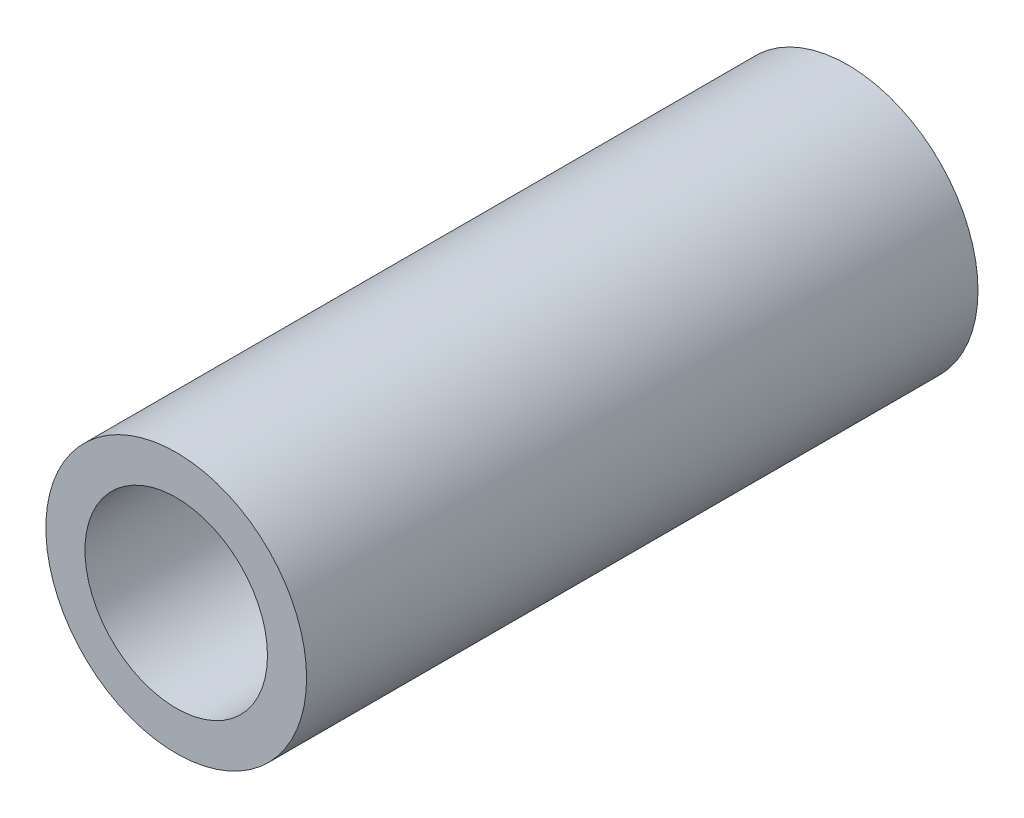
ISO-10303-21;
HEADER;
FILE_DESCRIPTION(('STEP AP214'),'2;1');
FILE_NAME('part.step','',(''),(''),'','','');
FILE_SCHEMA(('AUTOMOTIVE_DESIGN { 1 0 10303 214 1 1 1 1 }'));
ENDSEC;
DATA;
#1=APPLICATION_CONTEXT('core data for automotive mechanical design processes');
#2=APPLICATION_PROTOCOL_DEFINITION('international standard','automotive_design',2000,#1);
#3=PRODUCT_CONTEXT('',#1,'mechanical');
#4=PRODUCT('Part','Part','',(#3));
#5=PRODUCT_RELATED_PRODUCT_CATEGORY('part','',(#4));
#6=PRODUCT_DEFINITION_FORMATION('','',#4);
#7=PRODUCT_DEFINITION_CONTEXT('part definition',#1,'design');
#8=PRODUCT_DEFINITION('design','',#6,#7);
#9=PRODUCT_DEFINITION_SHAPE('','',#8);
#10=(LENGTH_UNIT() NAMED_UNIT(*) SI_UNIT(.MILLI.,.METRE.));
#11=(NAMED_UNIT(*) PLANE_ANGLE_UNIT() SI_UNIT($,.RADIAN.));
#12=(NAMED_UNIT(*) SI_UNIT($,.STERADIAN.) SOLID_ANGLE_UNIT());
#13=UNCERTAINTY_MEASURE_WITH_UNIT(LENGTH_MEASURE(1.E-05),#10,'distance_accuracy_value','');
#14=(GEOMETRIC_REPRESENTATION_CONTEXT(3) GLOBAL_UNCERTAINTY_ASSIGNED_CONTEXT((#13)) GLOBAL_UNIT_ASSIGNED_CONTEXT((#10,
#11,#12)) REPRESENTATION_CONTEXT('',''));
#15=CARTESIAN_POINT('',(0.,0.,0.));
#16=DIRECTION('',(0.,0.,1.));
#17=DIRECTION('',(1.,0.,0.));
#18=AXIS2_PLACEMENT_3D('',#15,#16,#17);
#19=CARTESIAN_POINT('',(0.,0.,52.324));
#20=DIRECTION('',(0.,0.,-1.));
#21=DIRECTION('',(-1.,0.,0.));
#22=AXIS2_PLACEMENT_3D('',#19,#20,#21);
#23=CYLINDRICAL_SURFACE('',#22,10.16);
#24=CARTESIAN_POINT('',(0.,0.,52.324));
#25=DIRECTION('',(0.,0.,1.));
#26=DIRECTION('',(1.,0.,0.));
#27=AXIS2_PLACEMENT_3D('',#24,#25,#26);
#28=CIRCLE('',#27,10.16);
#29=CARTESIAN_POINT('',(10.16,0.,52.324));
#30=VERTEX_POINT('',#29);
#31=EDGE_CURVE('E10',#30,#30,#28,.T.);
#32=ORIENTED_EDGE('',*,*,#31,.F.);
#33=EDGE_LOOP('',(#32));
#34=FACE_BOUND('',#33,.T.);
#35=CARTESIAN_POINT('',(0.,0.,0.));
#36=DIRECTION('',(0.,0.,1.));
#37=DIRECTION('',(1.,0.,0.));
#38=AXIS2_PLACEMENT_3D('',#35,#36,#37);
#39=CIRCLE('',#38,10.16);
#40=CARTESIAN_POINT('',(10.16,0.,0.));
#41=VERTEX_POINT('',#40);
#42=EDGE_CURVE('E37',#41,#41,#39,.T.);
#43=ORIENTED_EDGE('',*,*,#42,.T.);
#44=EDGE_LOOP('',(#43));
#45=FACE_BOUND('',#44,.T.);
#46=ADVANCED_FACE('F34',(#34,#45),#23,.T.);
#47=CARTESIAN_POINT('',(0.,0.,52.324));
#48=DIRECTION('',(0.,0.,1.));
#49=DIRECTION('',(1.,0.,0.));
#50=AXIS2_PLACEMENT_3D('',#47,#48,#49);
#51=PLANE('',#50);
#52=CARTESIAN_POINT('',(0.,0.,52.324));
#53=DIRECTION('',(0.,0.,1.));
#54=DIRECTION('',(1.,0.,0.));
#55=AXIS2_PLACEMENT_3D('',#52,#53,#54);
#56=CIRCLE('',#55,7.112);
#57=CARTESIAN_POINT('',(7.112,0.,52.324));
#58=VERTEX_POINT('',#57);
#59=EDGE_CURVE('E46',#58,#58,#56,.T.);
#60=ORIENTED_EDGE('',*,*,#59,.F.);
#61=EDGE_LOOP('',(#60));
#62=FACE_BOUND('',#61,.T.);
#63=ORIENTED_EDGE('',*,*,#31,.T.);
#64=EDGE_LOOP('',(#63));
#65=FACE_BOUND('',#64,.T.);
#66=ADVANCED_FACE('F61',(#62,#65),#51,.T.);
#67=CARTESIAN_POINT('',(0.,0.,0.));
#68=DIRECTION('',(0.,0.,1.));
#69=DIRECTION('',(1.,0.,0.));
#70=AXIS2_PLACEMENT_3D('',#67,#68,#69);
#71=PLANE('',#70);
#72=ORIENTED_EDGE('',*,*,#42,.F.);
#73=EDGE_LOOP('',(#72));
#74=FACE_BOUND('',#73,.T.);
#75=ADVANCED_FACE('F57',(#74),#71,.F.);
#76=CARTESIAN_POINT('',(0.,0.,1.524));
#77=DIRECTION('',(0.,0.,1.));
#78=DIRECTION('',(1.,0.,0.));
#79=AXIS2_PLACEMENT_3D('',#76,#77,#78);
#80=CYLINDRICAL_SURFACE('',#79,7.112);
#81=CARTESIAN_POINT('',(0.,0.,1.524));
#82=DIRECTION('',(0.,0.,1.));
#83=DIRECTION('',(1.,0.,0.));
#84=AXIS2_PLACEMENT_3D('',#81,#82,#83);
#85=CIRCLE('',#84,7.112);
#86=CARTESIAN_POINT('',(7.112,0.,1.524));
#87=VERTEX_POINT('',#86);
#88=EDGE_CURVE('E44',#87,#87,#85,.T.);
#89=ORIENTED_EDGE('',*,*,#88,.F.);
#90=EDGE_LOOP('',(#89));
#91=FACE_BOUND('',#90,.T.);
#92=ORIENTED_EDGE('',*,*,#59,.T.);
#93=EDGE_LOOP('',(#92));
#94=FACE_BOUND('',#93,.T.);
#95=ADVANCED_FACE('F54',(#91,#94),#80,.F.);
#96=CARTESIAN_POINT('',(0.,0.,1.524));
#97=DIRECTION('',(0.,0.,1.));
#98=DIRECTION('',(1.,0.,0.));
#99=AXIS2_PLACEMENT_3D('',#96,#97,#98);
#100=PLANE('',#99);
#101=ORIENTED_EDGE('',*,*,#88,.T.);
#102=EDGE_LOOP('',(#101));
#103=FACE_BOUND('',#102,.T.);
#104=ADVANCED_FACE('F52',(#103),#100,.T.);
#105=CLOSED_SHELL('',(#46,#66,#75,#95,#104));
#106=MANIFOLD_SOLID_BREP('B2',#105);
#107=ADVANCED_BREP_SHAPE_REPRESENTATION('',(#18,#106),#14);
#108=SHAPE_DEFINITION_REPRESENTATION(#9,#107);
ENDSEC;
END-ISO-10303-21;
